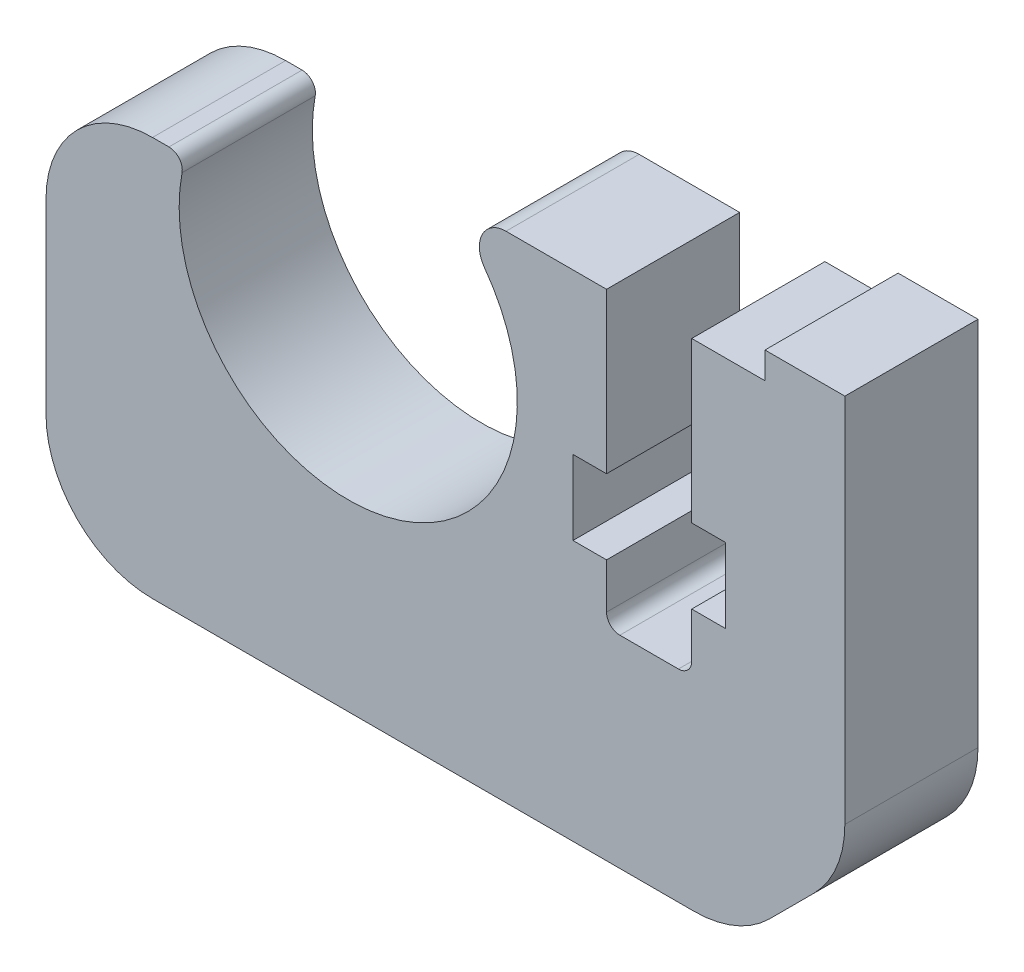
ISO-10303-21;
HEADER;
FILE_DESCRIPTION(('STEP AP214'),'2;1');
FILE_NAME('part.step','',(''),(''),'','','');
FILE_SCHEMA(('AUTOMOTIVE_DESIGN { 1 0 10303 214 1 1 1 1 }'));
ENDSEC;
DATA;
#1=APPLICATION_CONTEXT('core data for automotive mechanical design processes');
#2=APPLICATION_PROTOCOL_DEFINITION('international standard','automotive_design',2000,#1);
#3=PRODUCT_CONTEXT('',#1,'mechanical');
#4=PRODUCT('Part','Part','',(#3));
#5=PRODUCT_RELATED_PRODUCT_CATEGORY('part','',(#4));
#6=PRODUCT_DEFINITION_FORMATION('','',#4);
#7=PRODUCT_DEFINITION_CONTEXT('part definition',#1,'design');
#8=PRODUCT_DEFINITION('design','',#6,#7);
#9=PRODUCT_DEFINITION_SHAPE('','',#8);
#10=(LENGTH_UNIT() NAMED_UNIT(*) SI_UNIT(.MILLI.,.METRE.));
#11=(NAMED_UNIT(*) PLANE_ANGLE_UNIT() SI_UNIT($,.RADIAN.));
#12=(NAMED_UNIT(*) SI_UNIT($,.STERADIAN.) SOLID_ANGLE_UNIT());
#13=UNCERTAINTY_MEASURE_WITH_UNIT(LENGTH_MEASURE(1.E-05),#10,'distance_accuracy_value','');
#14=(GEOMETRIC_REPRESENTATION_CONTEXT(3) GLOBAL_UNCERTAINTY_ASSIGNED_CONTEXT((#13)) GLOBAL_UNIT_ASSIGNED_CONTEXT((#10,
#11,#12)) REPRESENTATION_CONTEXT('',''));
#15=CARTESIAN_POINT('',(0.,0.,0.));
#16=DIRECTION('',(0.,0.,1.));
#17=DIRECTION('',(1.,0.,0.));
#18=AXIS2_PLACEMENT_3D('',#15,#16,#17);
#19=CARTESIAN_POINT('',(-116.7,1.58749999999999,-34.425));
#20=DIRECTION('',(1.,0.,0.));
#21=DIRECTION('',(0.,0.,-1.));
#22=AXIS2_PLACEMENT_3D('',#19,#20,#21);
#23=PLANE('',#22);
#24=DIRECTION('',(0.,-1.,0.));
#25=VECTOR('',#24,1.);
#26=CARTESIAN_POINT('',(-116.7,1.58749999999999,-39.425));
#27=LINE('',#26,#25);
#28=CARTESIAN_POINT('',(-116.7,1.58749999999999,-39.425));
#29=VERTEX_POINT('',#28);
#30=CARTESIAN_POINT('',(-116.7,-12.3431457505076,-39.425));
#31=VERTEX_POINT('',#30);
#32=EDGE_CURVE('E253',#29,#31,#27,.T.);
#33=ORIENTED_EDGE('',*,*,#32,.F.);
#34=DIRECTION('',(0.,0.,-1.));
#35=VECTOR('',#34,1.);
#36=CARTESIAN_POINT('',(-116.7,1.58749999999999,-34.425));
#37=LINE('',#36,#35);
#38=CARTESIAN_POINT('',(-116.7,1.58749999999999,-34.425));
#39=VERTEX_POINT('',#38);
#40=EDGE_CURVE('E11',#39,#29,#37,.T.);
#41=ORIENTED_EDGE('',*,*,#40,.F.);
#42=DIRECTION('',(0.,-1.,0.));
#43=VECTOR('',#42,1.);
#44=CARTESIAN_POINT('',(-116.7,1.58749999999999,-34.425));
#45=LINE('',#44,#43);
#46=CARTESIAN_POINT('',(-116.7,-12.3431457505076,-34.425));
#47=VERTEX_POINT('',#46);
#48=EDGE_CURVE('E336',#39,#47,#45,.T.);
#49=ORIENTED_EDGE('',*,*,#48,.T.);
#50=DIRECTION('',(0.,0.,-1.));
#51=VECTOR('',#50,1.);
#52=CARTESIAN_POINT('',(-116.7,-12.3431457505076,-34.425));
#53=LINE('',#52,#51);
#54=EDGE_CURVE('E33',#47,#31,#53,.T.);
#55=ORIENTED_EDGE('',*,*,#54,.T.);
#56=EDGE_LOOP('',(#33,#41,#49,#55));
#57=FACE_BOUND('',#56,.T.);
#58=ADVANCED_FACE('F30',(#57),#23,.T.);
#59=CARTESIAN_POINT('',(-116.7,1.58749999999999,-34.425));
#60=DIRECTION('',(0.,1.,0.));
#61=DIRECTION('',(-1.,0.,0.));
#62=AXIS2_PLACEMENT_3D('',#59,#60,#61);
#63=PLANE('',#62);
#64=DIRECTION('',(1.,0.,0.));
#65=VECTOR('',#64,1.);
#66=CARTESIAN_POINT('',(-116.7,1.58749999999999,-39.425));
#67=LINE('',#66,#65);
#68=CARTESIAN_POINT('',(-119.7,1.58749999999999,-39.425));
#69=VERTEX_POINT('',#68);
#70=EDGE_CURVE('E334',#69,#29,#67,.T.);
#71=ORIENTED_EDGE('',*,*,#70,.F.);
#72=DIRECTION('',(0.,0.,-1.));
#73=VECTOR('',#72,1.);
#74=CARTESIAN_POINT('',(-119.7,1.58749999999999,-34.425));
#75=LINE('',#74,#73);
#76=CARTESIAN_POINT('',(-119.7,1.58749999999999,-34.425));
#77=VERTEX_POINT('',#76);
#78=EDGE_CURVE('E39',#77,#69,#75,.T.);
#79=ORIENTED_EDGE('',*,*,#78,.F.);
#80=DIRECTION('',(1.,0.,0.));
#81=VECTOR('',#80,1.);
#82=CARTESIAN_POINT('',(-116.7,1.58749999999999,-34.425));
#83=LINE('',#82,#81);
#84=EDGE_CURVE('E243',#77,#39,#83,.T.);
#85=ORIENTED_EDGE('',*,*,#84,.T.);
#86=ORIENTED_EDGE('',*,*,#40,.T.);
#87=EDGE_LOOP('',(#71,#79,#85,#86));
#88=FACE_BOUND('',#87,.T.);
#89=ADVANCED_FACE('F390',(#88),#63,.T.);
#90=CARTESIAN_POINT('',(-119.7,1.58749999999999,-34.425));
#91=DIRECTION('',(-1.,0.,0.));
#92=DIRECTION('',(0.,0.,1.));
#93=AXIS2_PLACEMENT_3D('',#90,#91,#92);
#94=PLANE('',#93);
#95=DIRECTION('',(0.,1.,0.));
#96=VECTOR('',#95,1.);
#97=CARTESIAN_POINT('',(-119.7,1.58749999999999,-39.425));
#98=LINE('',#97,#96);
#99=CARTESIAN_POINT('',(-119.7,0.587499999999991,-39.425));
#100=VERTEX_POINT('',#99);
#101=EDGE_CURVE('E230',#100,#69,#98,.T.);
#102=ORIENTED_EDGE('',*,*,#101,.F.);
#103=DIRECTION('',(0.,0.,-1.));
#104=VECTOR('',#103,1.);
#105=CARTESIAN_POINT('',(-119.7,0.587499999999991,-34.425));
#106=LINE('',#105,#104);
#107=CARTESIAN_POINT('',(-119.7,0.587499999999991,-34.425));
#108=VERTEX_POINT('',#107);
#109=EDGE_CURVE('E225',#108,#100,#106,.T.);
#110=ORIENTED_EDGE('',*,*,#109,.F.);
#111=DIRECTION('',(0.,1.,0.));
#112=VECTOR('',#111,1.);
#113=CARTESIAN_POINT('',(-119.7,1.58749999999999,-34.425));
#114=LINE('',#113,#112);
#115=EDGE_CURVE('E228',#108,#77,#114,.T.);
#116=ORIENTED_EDGE('',*,*,#115,.T.);
#117=ORIENTED_EDGE('',*,*,#78,.T.);
#118=EDGE_LOOP('',(#102,#110,#116,#117));
#119=FACE_BOUND('',#118,.T.);
#120=ADVANCED_FACE('F227',(#119),#94,.T.);
#121=CARTESIAN_POINT('',(-119.7,0.587499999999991,-34.425));
#122=DIRECTION('',(0.,1.,0.));
#123=DIRECTION('',(-1.,0.,0.));
#124=AXIS2_PLACEMENT_3D('',#121,#122,#123);
#125=PLANE('',#124);
#126=DIRECTION('',(1.,0.,0.));
#127=VECTOR('',#126,1.);
#128=CARTESIAN_POINT('',(-119.7,0.587499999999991,-39.425));
#129=LINE('',#128,#127);
#130=CARTESIAN_POINT('',(-122.45,0.587499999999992,-39.425));
#131=VERTEX_POINT('',#130);
#132=EDGE_CURVE('E331',#131,#100,#129,.T.);
#133=ORIENTED_EDGE('',*,*,#132,.F.);
#134=DIRECTION('',(0.,0.,-1.));
#135=VECTOR('',#134,1.);
#136=CARTESIAN_POINT('',(-122.45,0.587499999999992,-34.425));
#137=LINE('',#136,#135);
#138=CARTESIAN_POINT('',(-122.45,0.587499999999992,-34.425));
#139=VERTEX_POINT('',#138);
#140=EDGE_CURVE('E235',#139,#131,#137,.T.);
#141=ORIENTED_EDGE('',*,*,#140,.F.);
#142=DIRECTION('',(1.,0.,0.));
#143=VECTOR('',#142,1.);
#144=CARTESIAN_POINT('',(-119.7,0.587499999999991,-34.425));
#145=LINE('',#144,#143);
#146=EDGE_CURVE('E241',#139,#108,#145,.T.);
#147=ORIENTED_EDGE('',*,*,#146,.T.);
#148=ORIENTED_EDGE('',*,*,#109,.T.);
#149=EDGE_LOOP('',(#133,#141,#147,#148));
#150=FACE_BOUND('',#149,.T.);
#151=ADVANCED_FACE('F245',(#150),#125,.T.);
#152=CARTESIAN_POINT('',(-122.45,0.587499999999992,-34.425));
#153=DIRECTION('',(-1.,0.,0.));
#154=DIRECTION('',(0.,0.,1.));
#155=AXIS2_PLACEMENT_3D('',#152,#153,#154);
#156=PLANE('',#155);
#157=DIRECTION('',(0.,1.,0.));
#158=VECTOR('',#157,1.);
#159=CARTESIAN_POINT('',(-122.45,0.587499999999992,-39.425));
#160=LINE('',#159,#158);
#161=CARTESIAN_POINT('',(-122.45,-5.41250000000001,-39.425));
#162=VERTEX_POINT('',#161);
#163=EDGE_CURVE('E328',#162,#131,#160,.T.);
#164=ORIENTED_EDGE('',*,*,#163,.F.);
#165=DIRECTION('',(0.,0.,-1.));
#166=VECTOR('',#165,1.);
#167=CARTESIAN_POINT('',(-122.45,-5.41250000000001,-34.425));
#168=LINE('',#167,#166);
#169=CARTESIAN_POINT('',(-122.45,-5.41250000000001,-34.425));
#170=VERTEX_POINT('',#169);
#171=EDGE_CURVE('E340',#170,#162,#168,.T.);
#172=ORIENTED_EDGE('',*,*,#171,.F.);
#173=DIRECTION('',(0.,1.,0.));
#174=VECTOR('',#173,1.);
#175=CARTESIAN_POINT('',(-122.45,0.587499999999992,-34.425));
#176=LINE('',#175,#174);
#177=EDGE_CURVE('E246',#170,#139,#176,.T.);
#178=ORIENTED_EDGE('',*,*,#177,.T.);
#179=ORIENTED_EDGE('',*,*,#140,.T.);
#180=EDGE_LOOP('',(#164,#172,#178,#179));
#181=FACE_BOUND('',#180,.T.);
#182=ADVANCED_FACE('F403',(#181),#156,.T.);
#183=CARTESIAN_POINT('',(-122.45,-5.41250000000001,-34.425));
#184=DIRECTION('',(0.,-1.,0.));
#185=DIRECTION('',(1.,0.,0.));
#186=AXIS2_PLACEMENT_3D('',#183,#184,#185);
#187=PLANE('',#186);
#188=DIRECTION('',(-1.,0.,0.));
#189=VECTOR('',#188,1.);
#190=CARTESIAN_POINT('',(-122.45,-5.41250000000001,-39.425));
#191=LINE('',#190,#189);
#192=CARTESIAN_POINT('',(-121.19,-5.41250000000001,-39.425));
#193=VERTEX_POINT('',#192);
#194=EDGE_CURVE('E325',#193,#162,#191,.T.);
#195=ORIENTED_EDGE('',*,*,#194,.F.);
#196=DIRECTION('',(0.,0.,-1.));
#197=VECTOR('',#196,1.);
#198=CARTESIAN_POINT('',(-121.19,-5.41250000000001,-34.425));
#199=LINE('',#198,#197);
#200=CARTESIAN_POINT('',(-121.19,-5.41250000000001,-34.425));
#201=VERTEX_POINT('',#200);
#202=EDGE_CURVE('E342',#201,#193,#199,.T.);
#203=ORIENTED_EDGE('',*,*,#202,.F.);
#204=DIRECTION('',(-1.,0.,0.));
#205=VECTOR('',#204,1.);
#206=CARTESIAN_POINT('',(-122.45,-5.41250000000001,-34.425));
#207=LINE('',#206,#205);
#208=EDGE_CURVE('E248',#201,#170,#207,.T.);
#209=ORIENTED_EDGE('',*,*,#208,.T.);
#210=ORIENTED_EDGE('',*,*,#171,.T.);
#211=EDGE_LOOP('',(#195,#203,#209,#210));
#212=FACE_BOUND('',#211,.T.);
#213=ADVANCED_FACE('F406',(#212),#187,.T.);
#214=CARTESIAN_POINT('',(-121.19,-5.41250000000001,-34.425));
#215=DIRECTION('',(-1.,0.,0.));
#216=DIRECTION('',(0.,0.,1.));
#217=AXIS2_PLACEMENT_3D('',#214,#215,#216);
#218=PLANE('',#217);
#219=DIRECTION('',(0.,1.,0.));
#220=VECTOR('',#219,1.);
#221=CARTESIAN_POINT('',(-121.19,-5.41250000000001,-39.425));
#222=LINE('',#221,#220);
#223=CARTESIAN_POINT('',(-121.19,-8.21250000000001,-39.425));
#224=VERTEX_POINT('',#223);
#225=EDGE_CURVE('E322',#224,#193,#222,.T.);
#226=ORIENTED_EDGE('',*,*,#225,.F.);
#227=DIRECTION('',(0.,0.,-1.));
#228=VECTOR('',#227,1.);
#229=CARTESIAN_POINT('',(-121.19,-8.21250000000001,-34.425));
#230=LINE('',#229,#228);
#231=CARTESIAN_POINT('',(-121.19,-8.21250000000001,-34.425));
#232=VERTEX_POINT('',#231);
#233=EDGE_CURVE('E344',#232,#224,#230,.T.);
#234=ORIENTED_EDGE('',*,*,#233,.F.);
#235=DIRECTION('',(0.,1.,0.));
#236=VECTOR('',#235,1.);
#237=CARTESIAN_POINT('',(-121.19,-5.41250000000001,-34.425));
#238=LINE('',#237,#236);
#239=EDGE_CURVE('E768',#232,#201,#238,.T.);
#240=ORIENTED_EDGE('',*,*,#239,.T.);
#241=ORIENTED_EDGE('',*,*,#202,.T.);
#242=EDGE_LOOP('',(#226,#234,#240,#241));
#243=FACE_BOUND('',#242,.T.);
#244=ADVANCED_FACE('F410',(#243),#218,.T.);
#245=CARTESIAN_POINT('',(-121.19,-8.21250000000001,-34.425));
#246=DIRECTION('',(0.,1.,0.));
#247=DIRECTION('',(0.,0.,1.));
#248=AXIS2_PLACEMENT_3D('',#245,#246,#247);
#249=PLANE('',#248);
#250=DIRECTION('',(1.,0.,0.));
#251=VECTOR('',#250,1.);
#252=CARTESIAN_POINT('',(-121.19,-8.21250000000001,-39.425));
#253=LINE('',#252,#251);
#254=CARTESIAN_POINT('',(-122.45,-8.21250000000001,-39.425));
#255=VERTEX_POINT('',#254);
#256=EDGE_CURVE('E319',#255,#224,#253,.T.);
#257=ORIENTED_EDGE('',*,*,#256,.F.);
#258=DIRECTION('',(0.,0.,-1.));
#259=VECTOR('',#258,1.);
#260=CARTESIAN_POINT('',(-122.45,-8.21250000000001,-34.425));
#261=LINE('',#260,#259);
#262=CARTESIAN_POINT('',(-122.45,-8.21250000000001,-34.425));
#263=VERTEX_POINT('',#262);
#264=EDGE_CURVE('E346',#263,#255,#261,.T.);
#265=ORIENTED_EDGE('',*,*,#264,.F.);
#266=DIRECTION('',(1.,0.,0.));
#267=VECTOR('',#266,1.);
#268=CARTESIAN_POINT('',(-121.19,-8.21250000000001,-34.425));
#269=LINE('',#268,#267);
#270=EDGE_CURVE('E761',#263,#232,#269,.T.);
#271=ORIENTED_EDGE('',*,*,#270,.T.);
#272=ORIENTED_EDGE('',*,*,#233,.T.);
#273=EDGE_LOOP('',(#257,#265,#271,#272));
#274=FACE_BOUND('',#273,.T.);
#275=ADVANCED_FACE('F414',(#274),#249,.T.);
#276=CARTESIAN_POINT('',(-122.45,-8.21250000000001,-34.425));
#277=DIRECTION('',(-1.,0.,0.));
#278=DIRECTION('',(0.,0.,1.));
#279=AXIS2_PLACEMENT_3D('',#276,#277,#278);
#280=PLANE('',#279);
#281=DIRECTION('',(0.,1.,0.));
#282=VECTOR('',#281,1.);
#283=CARTESIAN_POINT('',(-122.45,-8.21250000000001,-39.425));
#284=LINE('',#283,#282);
#285=CARTESIAN_POINT('',(-122.45,-9.9125,-39.425));
#286=VERTEX_POINT('',#285);
#287=EDGE_CURVE('E316',#286,#255,#284,.T.);
#288=ORIENTED_EDGE('',*,*,#287,.F.);
#289=DIRECTION('',(0.,0.,-1.));
#290=VECTOR('',#289,1.);
#291=CARTESIAN_POINT('',(-122.45,-9.9125,-34.425));
#292=LINE('',#291,#290);
#293=CARTESIAN_POINT('',(-122.45,-9.9125,-34.425));
#294=VERTEX_POINT('',#293);
#295=EDGE_CURVE('E348',#294,#286,#292,.T.);
#296=ORIENTED_EDGE('',*,*,#295,.F.);
#297=DIRECTION('',(0.,1.,0.));
#298=VECTOR('',#297,1.);
#299=CARTESIAN_POINT('',(-122.45,-8.21250000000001,-34.425));
#300=LINE('',#299,#298);
#301=EDGE_CURVE('E757',#294,#263,#300,.T.);
#302=ORIENTED_EDGE('',*,*,#301,.T.);
#303=ORIENTED_EDGE('',*,*,#264,.T.);
#304=EDGE_LOOP('',(#288,#296,#302,#303));
#305=FACE_BOUND('',#304,.T.);
#306=ADVANCED_FACE('F418',(#305),#280,.T.);
#307=CARTESIAN_POINT('',(-122.95,-9.91250000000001,-34.425));
#308=DIRECTION('',(0.,0.,-1.));
#309=DIRECTION('',(-1.,0.,0.));
#310=AXIS2_PLACEMENT_3D('',#307,#308,#309);
#311=CYLINDRICAL_SURFACE('',#310,0.5);
#312=CARTESIAN_POINT('',(-122.95,-9.91250000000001,-39.425));
#313=DIRECTION('',(0.,0.,1.));
#314=DIRECTION('',(1.,0.,0.));
#315=AXIS2_PLACEMENT_3D('',#312,#313,#314);
#316=CIRCLE('',#315,0.5);
#317=CARTESIAN_POINT('',(-122.95,-10.4125,-39.425));
#318=VERTEX_POINT('',#317);
#319=EDGE_CURVE('E313',#318,#286,#316,.T.);
#320=ORIENTED_EDGE('',*,*,#319,.F.);
#321=DIRECTION('',(0.,0.,-1.));
#322=VECTOR('',#321,1.);
#323=CARTESIAN_POINT('',(-122.95,-10.4125,-34.425));
#324=LINE('',#323,#322);
#325=CARTESIAN_POINT('',(-122.95,-10.4125,-34.425));
#326=VERTEX_POINT('',#325);
#327=EDGE_CURVE('E350',#326,#318,#324,.T.);
#328=ORIENTED_EDGE('',*,*,#327,.F.);
#329=CARTESIAN_POINT('',(-122.95,-9.91250000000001,-34.425));
#330=DIRECTION('',(0.,0.,1.));
#331=DIRECTION('',(1.,0.,0.));
#332=AXIS2_PLACEMENT_3D('',#329,#330,#331);
#333=CIRCLE('',#332,0.5);
#334=EDGE_CURVE('E773',#326,#294,#333,.T.);
#335=ORIENTED_EDGE('',*,*,#334,.T.);
#336=ORIENTED_EDGE('',*,*,#295,.T.);
#337=EDGE_LOOP('',(#320,#328,#335,#336));
#338=FACE_BOUND('',#337,.T.);
#339=ADVANCED_FACE('F422',(#338),#311,.F.);
#340=CARTESIAN_POINT('',(-122.95,-10.4125,-34.425));
#341=DIRECTION('',(0.,1.,0.));
#342=DIRECTION('',(0.,0.,1.));
#343=AXIS2_PLACEMENT_3D('',#340,#341,#342);
#344=PLANE('',#343);
#345=DIRECTION('',(1.,0.,0.));
#346=VECTOR('',#345,1.);
#347=CARTESIAN_POINT('',(-122.95,-10.4125,-39.425));
#348=LINE('',#347,#346);
#349=CARTESIAN_POINT('',(-125.15,-10.4125,-39.425));
#350=VERTEX_POINT('',#349);
#351=EDGE_CURVE('E310',#350,#318,#348,.T.);
#352=ORIENTED_EDGE('',*,*,#351,.F.);
#353=DIRECTION('',(0.,0.,-1.));
#354=VECTOR('',#353,1.);
#355=CARTESIAN_POINT('',(-125.15,-10.4125,-34.425));
#356=LINE('',#355,#354);
#357=CARTESIAN_POINT('',(-125.15,-10.4125,-34.425));
#358=VERTEX_POINT('',#357);
#359=EDGE_CURVE('E352',#358,#350,#356,.T.);
#360=ORIENTED_EDGE('',*,*,#359,.F.);
#361=DIRECTION('',(1.,0.,0.));
#362=VECTOR('',#361,1.);
#363=CARTESIAN_POINT('',(-122.95,-10.4125,-34.425));
#364=LINE('',#363,#362);
#365=EDGE_CURVE('E750',#358,#326,#364,.T.);
#366=ORIENTED_EDGE('',*,*,#365,.T.);
#367=ORIENTED_EDGE('',*,*,#327,.T.);
#368=EDGE_LOOP('',(#352,#360,#366,#367));
#369=FACE_BOUND('',#368,.T.);
#370=ADVANCED_FACE('F426',(#369),#344,.T.);
#371=CARTESIAN_POINT('',(-125.15,-9.91250000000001,-34.425));
#372=DIRECTION('',(0.,0.,-1.));
#373=DIRECTION('',(-1.,0.,0.));
#374=AXIS2_PLACEMENT_3D('',#371,#372,#373);
#375=CYLINDRICAL_SURFACE('',#374,0.5);
#376=CARTESIAN_POINT('',(-125.15,-9.91250000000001,-39.425));
#377=DIRECTION('',(0.,0.,1.));
#378=DIRECTION('',(-1.,0.,0.));
#379=AXIS2_PLACEMENT_3D('',#376,#377,#378);
#380=CIRCLE('',#379,0.5);
#381=CARTESIAN_POINT('',(-125.65,-9.9125,-39.425));
#382=VERTEX_POINT('',#381);
#383=EDGE_CURVE('E307',#382,#350,#380,.T.);
#384=ORIENTED_EDGE('',*,*,#383,.F.);
#385=DIRECTION('',(0.,0.,-1.));
#386=VECTOR('',#385,1.);
#387=CARTESIAN_POINT('',(-125.65,-9.9125,-34.425));
#388=LINE('',#387,#386);
#389=CARTESIAN_POINT('',(-125.65,-9.9125,-34.425));
#390=VERTEX_POINT('',#389);
#391=EDGE_CURVE('E354',#390,#382,#388,.T.);
#392=ORIENTED_EDGE('',*,*,#391,.F.);
#393=CARTESIAN_POINT('',(-125.15,-9.91250000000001,-34.425));
#394=DIRECTION('',(0.,0.,1.));
#395=DIRECTION('',(-1.,0.,0.));
#396=AXIS2_PLACEMENT_3D('',#393,#394,#395);
#397=CIRCLE('',#396,0.5);
#398=EDGE_CURVE('E746',#390,#358,#397,.T.);
#399=ORIENTED_EDGE('',*,*,#398,.T.);
#400=ORIENTED_EDGE('',*,*,#359,.T.);
#401=EDGE_LOOP('',(#384,#392,#399,#400));
#402=FACE_BOUND('',#401,.T.);
#403=ADVANCED_FACE('F430',(#402),#375,.F.);
#404=CARTESIAN_POINT('',(-125.65,-8.21250000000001,-34.425));
#405=DIRECTION('',(1.,0.,0.));
#406=DIRECTION('',(0.,0.,-1.));
#407=AXIS2_PLACEMENT_3D('',#404,#405,#406);
#408=PLANE('',#407);
#409=DIRECTION('',(0.,-1.,0.));
#410=VECTOR('',#409,1.);
#411=CARTESIAN_POINT('',(-125.65,-8.21250000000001,-39.425));
#412=LINE('',#411,#410);
#413=CARTESIAN_POINT('',(-125.65,-8.21250000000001,-39.425));
#414=VERTEX_POINT('',#413);
#415=EDGE_CURVE('E304',#414,#382,#412,.T.);
#416=ORIENTED_EDGE('',*,*,#415,.F.);
#417=DIRECTION('',(0.,0.,-1.));
#418=VECTOR('',#417,1.);
#419=CARTESIAN_POINT('',(-125.65,-8.21250000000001,-34.425));
#420=LINE('',#419,#418);
#421=CARTESIAN_POINT('',(-125.65,-8.21250000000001,-34.425));
#422=VERTEX_POINT('',#421);
#423=EDGE_CURVE('E356',#422,#414,#420,.T.);
#424=ORIENTED_EDGE('',*,*,#423,.F.);
#425=DIRECTION('',(0.,-1.,0.));
#426=VECTOR('',#425,1.);
#427=CARTESIAN_POINT('',(-125.65,-8.21250000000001,-34.425));
#428=LINE('',#427,#426);
#429=EDGE_CURVE('E777',#422,#390,#428,.T.);
#430=ORIENTED_EDGE('',*,*,#429,.T.);
#431=ORIENTED_EDGE('',*,*,#391,.T.);
#432=EDGE_LOOP('',(#416,#424,#430,#431));
#433=FACE_BOUND('',#432,.T.);
#434=ADVANCED_FACE('F434',(#433),#408,.T.);
#435=CARTESIAN_POINT('',(-126.91,-8.21250000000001,-34.425));
#436=DIRECTION('',(0.,1.,0.));
#437=DIRECTION('',(0.,0.,1.));
#438=AXIS2_PLACEMENT_3D('',#435,#436,#437);
#439=PLANE('',#438);
#440=DIRECTION('',(1.,0.,0.));
#441=VECTOR('',#440,1.);
#442=CARTESIAN_POINT('',(-126.91,-8.21250000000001,-39.425));
#443=LINE('',#442,#441);
#444=CARTESIAN_POINT('',(-126.91,-8.21250000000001,-39.425));
#445=VERTEX_POINT('',#444);
#446=EDGE_CURVE('E301',#445,#414,#443,.T.);
#447=ORIENTED_EDGE('',*,*,#446,.F.);
#448=DIRECTION('',(0.,0.,-1.));
#449=VECTOR('',#448,1.);
#450=CARTESIAN_POINT('',(-126.91,-8.21250000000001,-34.425));
#451=LINE('',#450,#449);
#452=CARTESIAN_POINT('',(-126.91,-8.21250000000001,-34.425));
#453=VERTEX_POINT('',#452);
#454=EDGE_CURVE('E358',#453,#445,#451,.T.);
#455=ORIENTED_EDGE('',*,*,#454,.F.);
#456=DIRECTION('',(1.,0.,0.));
#457=VECTOR('',#456,1.);
#458=CARTESIAN_POINT('',(-126.91,-8.21250000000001,-34.425));
#459=LINE('',#458,#457);
#460=EDGE_CURVE('E739',#453,#422,#459,.T.);
#461=ORIENTED_EDGE('',*,*,#460,.T.);
#462=ORIENTED_EDGE('',*,*,#423,.T.);
#463=EDGE_LOOP('',(#447,#455,#461,#462));
#464=FACE_BOUND('',#463,.T.);
#465=ADVANCED_FACE('F438',(#464),#439,.T.);
#466=CARTESIAN_POINT('',(-126.91,-5.41250000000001,-34.425));
#467=DIRECTION('',(1.,0.,0.));
#468=DIRECTION('',(0.,0.,-1.));
#469=AXIS2_PLACEMENT_3D('',#466,#467,#468);
#470=PLANE('',#469);
#471=DIRECTION('',(0.,-1.,0.));
#472=VECTOR('',#471,1.);
#473=CARTESIAN_POINT('',(-126.91,-5.41250000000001,-39.425));
#474=LINE('',#473,#472);
#475=CARTESIAN_POINT('',(-126.91,-5.41250000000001,-39.425));
#476=VERTEX_POINT('',#475);
#477=EDGE_CURVE('E298',#476,#445,#474,.T.);
#478=ORIENTED_EDGE('',*,*,#477,.F.);
#479=DIRECTION('',(0.,0.,-1.));
#480=VECTOR('',#479,1.);
#481=CARTESIAN_POINT('',(-126.91,-5.41250000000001,-34.425));
#482=LINE('',#481,#480);
#483=CARTESIAN_POINT('',(-126.91,-5.41250000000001,-34.425));
#484=VERTEX_POINT('',#483);
#485=EDGE_CURVE('E360',#484,#476,#482,.T.);
#486=ORIENTED_EDGE('',*,*,#485,.F.);
#487=DIRECTION('',(0.,-1.,0.));
#488=VECTOR('',#487,1.);
#489=CARTESIAN_POINT('',(-126.91,-5.41250000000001,-34.425));
#490=LINE('',#489,#488);
#491=EDGE_CURVE('E735',#484,#453,#490,.T.);
#492=ORIENTED_EDGE('',*,*,#491,.T.);
#493=ORIENTED_EDGE('',*,*,#454,.T.);
#494=EDGE_LOOP('',(#478,#486,#492,#493));
#495=FACE_BOUND('',#494,.T.);
#496=ADVANCED_FACE('F442',(#495),#470,.T.);
#497=CARTESIAN_POINT('',(-125.65,-5.41250000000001,-34.425));
#498=DIRECTION('',(0.,-1.,0.));
#499=DIRECTION('',(1.,0.,0.));
#500=AXIS2_PLACEMENT_3D('',#497,#498,#499);
#501=PLANE('',#500);
#502=DIRECTION('',(-1.,0.,0.));
#503=VECTOR('',#502,1.);
#504=CARTESIAN_POINT('',(-125.65,-5.41250000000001,-39.425));
#505=LINE('',#504,#503);
#506=CARTESIAN_POINT('',(-125.65,-5.41250000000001,-39.425));
#507=VERTEX_POINT('',#506);
#508=EDGE_CURVE('E295',#507,#476,#505,.T.);
#509=ORIENTED_EDGE('',*,*,#508,.F.);
#510=DIRECTION('',(0.,0.,-1.));
#511=VECTOR('',#510,1.);
#512=CARTESIAN_POINT('',(-125.65,-5.41250000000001,-34.425));
#513=LINE('',#512,#511);
#514=CARTESIAN_POINT('',(-125.65,-5.41250000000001,-34.425));
#515=VERTEX_POINT('',#514);
#516=EDGE_CURVE('E362',#515,#507,#513,.T.);
#517=ORIENTED_EDGE('',*,*,#516,.F.);
#518=DIRECTION('',(-1.,0.,0.));
#519=VECTOR('',#518,1.);
#520=CARTESIAN_POINT('',(-125.65,-5.41250000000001,-34.425));
#521=LINE('',#520,#519);
#522=EDGE_CURVE('E781',#515,#484,#521,.T.);
#523=ORIENTED_EDGE('',*,*,#522,.T.);
#524=ORIENTED_EDGE('',*,*,#485,.T.);
#525=EDGE_LOOP('',(#509,#517,#523,#524));
#526=FACE_BOUND('',#525,.T.);
#527=ADVANCED_FACE('F446',(#526),#501,.T.);
#528=CARTESIAN_POINT('',(-125.65,0.587499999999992,-34.425));
#529=DIRECTION('',(1.,0.,0.));
#530=DIRECTION('',(0.,0.,-1.));
#531=AXIS2_PLACEMENT_3D('',#528,#529,#530);
#532=PLANE('',#531);
#533=DIRECTION('',(0.,-1.,0.));
#534=VECTOR('',#533,1.);
#535=CARTESIAN_POINT('',(-125.65,0.587499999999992,-39.425));
#536=LINE('',#535,#534);
#537=CARTESIAN_POINT('',(-125.65,0.587499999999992,-39.425));
#538=VERTEX_POINT('',#537);
#539=EDGE_CURVE('E292',#538,#507,#536,.T.);
#540=ORIENTED_EDGE('',*,*,#539,.F.);
#541=DIRECTION('',(0.,0.,-1.));
#542=VECTOR('',#541,1.);
#543=CARTESIAN_POINT('',(-125.65,0.587499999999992,-34.425));
#544=LINE('',#543,#542);
#545=CARTESIAN_POINT('',(-125.65,0.587499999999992,-34.425));
#546=VERTEX_POINT('',#545);
#547=EDGE_CURVE('E364',#546,#538,#544,.T.);
#548=ORIENTED_EDGE('',*,*,#547,.F.);
#549=DIRECTION('',(0.,-1.,0.));
#550=VECTOR('',#549,1.);
#551=CARTESIAN_POINT('',(-125.65,0.587499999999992,-34.425));
#552=LINE('',#551,#550);
#553=EDGE_CURVE('E728',#546,#515,#552,.T.);
#554=ORIENTED_EDGE('',*,*,#553,.T.);
#555=ORIENTED_EDGE('',*,*,#516,.T.);
#556=EDGE_LOOP('',(#540,#548,#554,#555));
#557=FACE_BOUND('',#556,.T.);
#558=ADVANCED_FACE('F450',(#557),#532,.T.);
#559=CARTESIAN_POINT('',(-125.65,0.587499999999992,-34.425));
#560=DIRECTION('',(0.,1.,0.));
#561=DIRECTION('',(-1.,0.,0.));
#562=AXIS2_PLACEMENT_3D('',#559,#560,#561);
#563=PLANE('',#562);
#564=DIRECTION('',(1.,0.,0.));
#565=VECTOR('',#564,1.);
#566=CARTESIAN_POINT('',(-125.65,0.587499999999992,-39.425));
#567=LINE('',#566,#565);
#568=CARTESIAN_POINT('',(-129.425474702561,0.587499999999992,-39.425));
#569=VERTEX_POINT('',#568);
#570=EDGE_CURVE('E289',#569,#538,#567,.T.);
#571=ORIENTED_EDGE('',*,*,#570,.F.);
#572=DIRECTION('',(0.,0.,-1.));
#573=VECTOR('',#572,1.);
#574=CARTESIAN_POINT('',(-129.425474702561,0.587499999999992,-34.425));
#575=LINE('',#574,#573);
#576=CARTESIAN_POINT('',(-129.425474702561,0.587499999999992,-34.425));
#577=VERTEX_POINT('',#576);
#578=EDGE_CURVE('E366',#577,#569,#575,.T.);
#579=ORIENTED_EDGE('',*,*,#578,.F.);
#580=DIRECTION('',(1.,0.,0.));
#581=VECTOR('',#580,1.);
#582=CARTESIAN_POINT('',(-125.65,0.587499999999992,-34.425));
#583=LINE('',#582,#581);
#584=EDGE_CURVE('E724',#577,#546,#583,.T.);
#585=ORIENTED_EDGE('',*,*,#584,.T.);
#586=ORIENTED_EDGE('',*,*,#547,.T.);
#587=EDGE_LOOP('',(#571,#579,#585,#586));
#588=FACE_BOUND('',#587,.T.);
#589=ADVANCED_FACE('F454',(#588),#563,.T.);
#590=CARTESIAN_POINT('',(-129.425474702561,-0.412500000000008,-34.425));
#591=DIRECTION('',(0.,0.,-1.));
#592=DIRECTION('',(-1.,0.,0.));
#593=AXIS2_PLACEMENT_3D('',#590,#591,#592);
#594=CYLINDRICAL_SURFACE('',#593,0.999999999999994);
#595=CARTESIAN_POINT('',(-129.425474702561,-0.412500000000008,-39.425));
#596=DIRECTION('',(0.,0.,-1.));
#597=DIRECTION('',(-1.,0.,0.));
#598=AXIS2_PLACEMENT_3D('',#595,#596,#597);
#599=CIRCLE('',#598,0.999999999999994);
#600=CARTESIAN_POINT('',(-130.231532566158,-1.00433673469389,-39.425));
#601=VERTEX_POINT('',#600);
#602=EDGE_CURVE('E286',#601,#569,#599,.T.);
#603=ORIENTED_EDGE('',*,*,#602,.F.);
#604=DIRECTION('',(0.,0.,-1.));
#605=VECTOR('',#604,1.);
#606=CARTESIAN_POINT('',(-130.231532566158,-1.00433673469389,-34.425));
#607=LINE('',#606,#605);
#608=CARTESIAN_POINT('',(-130.231532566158,-1.00433673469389,-34.425));
#609=VERTEX_POINT('',#608);
#610=EDGE_CURVE('E368',#609,#601,#607,.T.);
#611=ORIENTED_EDGE('',*,*,#610,.F.);
#612=CARTESIAN_POINT('',(-129.425474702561,-0.412500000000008,-34.425));
#613=DIRECTION('',(0.,0.,-1.));
#614=DIRECTION('',(-1.,0.,0.));
#615=AXIS2_PLACEMENT_3D('',#612,#613,#614);
#616=CIRCLE('',#615,0.999999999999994);
#617=EDGE_CURVE('E785',#609,#577,#616,.T.);
#618=ORIENTED_EDGE('',*,*,#617,.T.);
#619=ORIENTED_EDGE('',*,*,#578,.T.);
#620=EDGE_LOOP('',(#603,#611,#618,#619));
#621=FACE_BOUND('',#620,.T.);
#622=ADVANCED_FACE('F458',(#621),#594,.T.);
#623=CARTESIAN_POINT('',(-135.35,-4.7625,-34.425));
#624=DIRECTION('',(0.,0.,-1.));
#625=DIRECTION('',(-1.,0.,0.));
#626=AXIS2_PLACEMENT_3D('',#623,#624,#625);
#627=CYLINDRICAL_SURFACE('',#626,6.35);
#628=CARTESIAN_POINT('',(-135.35,-4.7625,-39.425));
#629=DIRECTION('',(0.,0.,1.));
#630=DIRECTION('',(-1.,0.,0.));
#631=AXIS2_PLACEMENT_3D('',#628,#629,#630);
#632=CIRCLE('',#631,6.35);
#633=CARTESIAN_POINT('',(-141.591216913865,-3.59215328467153,-39.425));
#634=VERTEX_POINT('',#633);
#635=EDGE_CURVE('E283',#634,#601,#632,.T.);
#636=ORIENTED_EDGE('',*,*,#635,.F.);
#637=DIRECTION('',(0.,0.,-1.));
#638=VECTOR('',#637,1.);
#639=CARTESIAN_POINT('',(-141.591216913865,-3.59215328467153,-34.425));
#640=LINE('',#639,#638);
#641=CARTESIAN_POINT('',(-141.591216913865,-3.59215328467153,-34.425));
#642=VERTEX_POINT('',#641);
#643=EDGE_CURVE('E370',#642,#634,#640,.T.);
#644=ORIENTED_EDGE('',*,*,#643,.F.);
#645=CARTESIAN_POINT('',(-135.35,-4.7625,-34.425));
#646=DIRECTION('',(0.,0.,1.));
#647=DIRECTION('',(-1.,0.,0.));
#648=AXIS2_PLACEMENT_3D('',#645,#646,#647);
#649=CIRCLE('',#648,6.35);
#650=EDGE_CURVE('E717',#642,#609,#649,.T.);
#651=ORIENTED_EDGE('',*,*,#650,.T.);
#652=ORIENTED_EDGE('',*,*,#610,.T.);
#653=EDGE_LOOP('',(#636,#644,#651,#652));
#654=FACE_BOUND('',#653,.T.);
#655=ADVANCED_FACE('F462',(#654),#627,.F.);
#656=CARTESIAN_POINT('',(-142.082651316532,-3.5,-34.425));
#657=DIRECTION('',(0.,0.,-1.));
#658=DIRECTION('',(-1.,0.,0.));
#659=AXIS2_PLACEMENT_3D('',#656,#657,#658);
#660=CYLINDRICAL_SURFACE('',#659,0.499999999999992);
#661=CARTESIAN_POINT('',(-142.082651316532,-3.5,-39.425));
#662=DIRECTION('',(0.,0.,-1.));
#663=DIRECTION('',(1.,0.,0.));
#664=AXIS2_PLACEMENT_3D('',#661,#662,#663);
#665=CIRCLE('',#664,0.499999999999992);
#666=CARTESIAN_POINT('',(-142.082651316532,-3.00000000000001,-39.425));
#667=VERTEX_POINT('',#666);
#668=EDGE_CURVE('E280',#667,#634,#665,.T.);
#669=ORIENTED_EDGE('',*,*,#668,.F.);
#670=DIRECTION('',(0.,0.,-1.));
#671=VECTOR('',#670,1.);
#672=CARTESIAN_POINT('',(-142.082651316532,-3.00000000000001,-34.425));
#673=LINE('',#672,#671);
#674=CARTESIAN_POINT('',(-142.082651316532,-3.00000000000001,-34.425));
#675=VERTEX_POINT('',#674);
#676=EDGE_CURVE('E372',#675,#667,#673,.T.);
#677=ORIENTED_EDGE('',*,*,#676,.F.);
#678=CARTESIAN_POINT('',(-142.082651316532,-3.5,-34.425));
#679=DIRECTION('',(0.,0.,-1.));
#680=DIRECTION('',(1.,0.,0.));
#681=AXIS2_PLACEMENT_3D('',#678,#679,#680);
#682=CIRCLE('',#681,0.499999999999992);
#683=EDGE_CURVE('E713',#675,#642,#682,.T.);
#684=ORIENTED_EDGE('',*,*,#683,.T.);
#685=ORIENTED_EDGE('',*,*,#643,.T.);
#686=EDGE_LOOP('',(#669,#677,#684,#685));
#687=FACE_BOUND('',#686,.T.);
#688=ADVANCED_FACE('F466',(#687),#660,.T.);
#689=CARTESIAN_POINT('',(-142.7,-3.,-34.425));
#690=DIRECTION('',(0.,1.,0.));
#691=DIRECTION('',(0.,0.,1.));
#692=AXIS2_PLACEMENT_3D('',#689,#690,#691);
#693=PLANE('',#692);
#694=DIRECTION('',(1.,0.,0.));
#695=VECTOR('',#694,1.);
#696=CARTESIAN_POINT('',(-142.7,-3.,-39.425));
#697=LINE('',#696,#695);
#698=CARTESIAN_POINT('',(-142.7,-3.,-39.425));
#699=VERTEX_POINT('',#698);
#700=EDGE_CURVE('E277',#699,#667,#697,.T.);
#701=ORIENTED_EDGE('',*,*,#700,.F.);
#702=DIRECTION('',(0.,0.,-1.));
#703=VECTOR('',#702,1.);
#704=CARTESIAN_POINT('',(-142.7,-3.,-34.425));
#705=LINE('',#704,#703);
#706=CARTESIAN_POINT('',(-142.7,-3.,-34.425));
#707=VERTEX_POINT('',#706);
#708=EDGE_CURVE('E374',#707,#699,#705,.T.);
#709=ORIENTED_EDGE('',*,*,#708,.F.);
#710=DIRECTION('',(1.,0.,0.));
#711=VECTOR('',#710,1.);
#712=CARTESIAN_POINT('',(-142.7,-3.,-34.425));
#713=LINE('',#712,#711);
#714=EDGE_CURVE('E789',#707,#675,#713,.T.);
#715=ORIENTED_EDGE('',*,*,#714,.T.);
#716=ORIENTED_EDGE('',*,*,#676,.T.);
#717=EDGE_LOOP('',(#701,#709,#715,#716));
#718=FACE_BOUND('',#717,.T.);
#719=ADVANCED_FACE('F470',(#718),#693,.T.);
#720=CARTESIAN_POINT('',(-142.7,-7.,-34.425));
#721=DIRECTION('',(0.,0.,-1.));
#722=DIRECTION('',(-1.,0.,0.));
#723=AXIS2_PLACEMENT_3D('',#720,#721,#722);
#724=CYLINDRICAL_SURFACE('',#723,4.);
#725=CARTESIAN_POINT('',(-142.7,-7.,-39.425));
#726=DIRECTION('',(0.,0.,-1.));
#727=DIRECTION('',(-1.,0.,0.));
#728=AXIS2_PLACEMENT_3D('',#725,#726,#727);
#729=CIRCLE('',#728,4.);
#730=CARTESIAN_POINT('',(-146.7,-7.00000000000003,-39.425));
#731=VERTEX_POINT('',#730);
#732=EDGE_CURVE('E274',#731,#699,#729,.T.);
#733=ORIENTED_EDGE('',*,*,#732,.F.);
#734=DIRECTION('',(0.,0.,-1.));
#735=VECTOR('',#734,1.);
#736=CARTESIAN_POINT('',(-146.7,-7.00000000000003,-34.425));
#737=LINE('',#736,#735);
#738=CARTESIAN_POINT('',(-146.7,-7.00000000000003,-34.425));
#739=VERTEX_POINT('',#738);
#740=EDGE_CURVE('E376',#739,#731,#737,.T.);
#741=ORIENTED_EDGE('',*,*,#740,.F.);
#742=CARTESIAN_POINT('',(-142.7,-7.,-34.425));
#743=DIRECTION('',(0.,0.,-1.));
#744=DIRECTION('',(-1.,0.,0.));
#745=AXIS2_PLACEMENT_3D('',#742,#743,#744);
#746=CIRCLE('',#745,4.);
#747=EDGE_CURVE('E706',#739,#707,#746,.T.);
#748=ORIENTED_EDGE('',*,*,#747,.T.);
#749=ORIENTED_EDGE('',*,*,#708,.T.);
#750=EDGE_LOOP('',(#733,#741,#748,#749));
#751=FACE_BOUND('',#750,.T.);
#752=ADVANCED_FACE('F474',(#751),#724,.T.);
#753=CARTESIAN_POINT('',(-146.7,-14.,-34.425));
#754=DIRECTION('',(-1.,0.,0.));
#755=DIRECTION('',(0.,0.,1.));
#756=AXIS2_PLACEMENT_3D('',#753,#754,#755);
#757=PLANE('',#756);
#758=DIRECTION('',(0.,1.,0.));
#759=VECTOR('',#758,1.);
#760=CARTESIAN_POINT('',(-146.7,-14.,-39.425));
#761=LINE('',#760,#759);
#762=CARTESIAN_POINT('',(-146.7,-14.,-39.425));
#763=VERTEX_POINT('',#762);
#764=EDGE_CURVE('E271',#763,#731,#761,.T.);
#765=ORIENTED_EDGE('',*,*,#764,.F.);
#766=DIRECTION('',(0.,0.,-1.));
#767=VECTOR('',#766,1.);
#768=CARTESIAN_POINT('',(-146.7,-14.,-34.425));
#769=LINE('',#768,#767);
#770=CARTESIAN_POINT('',(-146.7,-14.,-34.425));
#771=VERTEX_POINT('',#770);
#772=EDGE_CURVE('E378',#771,#763,#769,.T.);
#773=ORIENTED_EDGE('',*,*,#772,.F.);
#774=DIRECTION('',(0.,1.,0.));
#775=VECTOR('',#774,1.);
#776=CARTESIAN_POINT('',(-146.7,-14.,-34.425));
#777=LINE('',#776,#775);
#778=EDGE_CURVE('E702',#771,#739,#777,.T.);
#779=ORIENTED_EDGE('',*,*,#778,.T.);
#780=ORIENTED_EDGE('',*,*,#740,.T.);
#781=EDGE_LOOP('',(#765,#773,#779,#780));
#782=FACE_BOUND('',#781,.T.);
#783=ADVANCED_FACE('F478',(#782),#757,.T.);
#784=CARTESIAN_POINT('',(-142.7,-14.,-34.425));
#785=DIRECTION('',(0.,0.,-1.));
#786=DIRECTION('',(-1.,0.,0.));
#787=AXIS2_PLACEMENT_3D('',#784,#785,#786);
#788=CYLINDRICAL_SURFACE('',#787,4.);
#789=CARTESIAN_POINT('',(-142.7,-14.,-39.425));
#790=DIRECTION('',(0.,0.,-1.));
#791=DIRECTION('',(1.,0.,0.));
#792=AXIS2_PLACEMENT_3D('',#789,#790,#791);
#793=CIRCLE('',#792,4.);
#794=CARTESIAN_POINT('',(-142.7,-18.,-39.425));
#795=VERTEX_POINT('',#794);
#796=EDGE_CURVE('E268',#795,#763,#793,.T.);
#797=ORIENTED_EDGE('',*,*,#796,.F.);
#798=DIRECTION('',(0.,0.,-1.));
#799=VECTOR('',#798,1.);
#800=CARTESIAN_POINT('',(-142.7,-18.,-34.425));
#801=LINE('',#800,#799);
#802=CARTESIAN_POINT('',(-142.7,-18.,-34.425));
#803=VERTEX_POINT('',#802);
#804=EDGE_CURVE('E380',#803,#795,#801,.T.);
#805=ORIENTED_EDGE('',*,*,#804,.F.);
#806=CARTESIAN_POINT('',(-142.7,-14.,-34.425));
#807=DIRECTION('',(0.,0.,-1.));
#808=DIRECTION('',(1.,0.,0.));
#809=AXIS2_PLACEMENT_3D('',#806,#807,#808);
#810=CIRCLE('',#809,4.);
#811=EDGE_CURVE('E793',#803,#771,#810,.T.);
#812=ORIENTED_EDGE('',*,*,#811,.T.);
#813=ORIENTED_EDGE('',*,*,#772,.T.);
#814=EDGE_LOOP('',(#797,#805,#812,#813));
#815=FACE_BOUND('',#814,.T.);
#816=ADVANCED_FACE('F482',(#815),#788,.T.);
#817=CARTESIAN_POINT('',(-122.356854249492,-18.,-34.425));
#818=DIRECTION('',(0.,-1.,0.));
#819=DIRECTION('',(0.,0.,-1.));
#820=AXIS2_PLACEMENT_3D('',#817,#818,#819);
#821=PLANE('',#820);
#822=DIRECTION('',(-1.,0.,0.));
#823=VECTOR('',#822,1.);
#824=CARTESIAN_POINT('',(-122.356854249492,-18.,-39.425));
#825=LINE('',#824,#823);
#826=CARTESIAN_POINT('',(-122.356854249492,-18.,-39.425));
#827=VERTEX_POINT('',#826);
#828=EDGE_CURVE('E265',#827,#795,#825,.T.);
#829=ORIENTED_EDGE('',*,*,#828,.F.);
#830=DIRECTION('',(0.,0.,-1.));
#831=VECTOR('',#830,1.);
#832=CARTESIAN_POINT('',(-122.356854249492,-18.,-34.425));
#833=LINE('',#832,#831);
#834=CARTESIAN_POINT('',(-122.356854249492,-18.,-34.425));
#835=VERTEX_POINT('',#834);
#836=EDGE_CURVE('E382',#835,#827,#833,.T.);
#837=ORIENTED_EDGE('',*,*,#836,.F.);
#838=DIRECTION('',(-1.,0.,0.));
#839=VECTOR('',#838,1.);
#840=CARTESIAN_POINT('',(-122.356854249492,-18.,-34.425));
#841=LINE('',#840,#839);
#842=EDGE_CURVE('E695',#835,#803,#841,.T.);
#843=ORIENTED_EDGE('',*,*,#842,.T.);
#844=ORIENTED_EDGE('',*,*,#804,.T.);
#845=EDGE_LOOP('',(#829,#837,#843,#844));
#846=FACE_BOUND('',#845,.T.);
#847=ADVANCED_FACE('F486',(#846),#821,.T.);
#848=CARTESIAN_POINT('',(-122.356854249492,-14.,-34.425));
#849=DIRECTION('',(0.,0.,-1.));
#850=DIRECTION('',(-1.,0.,0.));
#851=AXIS2_PLACEMENT_3D('',#848,#849,#850);
#852=CYLINDRICAL_SURFACE('',#851,4.00000000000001);
#853=CARTESIAN_POINT('',(-122.356854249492,-14.,-39.425));
#854=DIRECTION('',(0.,0.,-1.));
#855=DIRECTION('',(1.,0.,0.));
#856=AXIS2_PLACEMENT_3D('',#853,#854,#855);
#857=CIRCLE('',#856,4.00000000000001);
#858=CARTESIAN_POINT('',(-119.528427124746,-16.8284271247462,-39.425));
#859=VERTEX_POINT('',#858);
#860=EDGE_CURVE('E262',#859,#827,#857,.T.);
#861=ORIENTED_EDGE('',*,*,#860,.F.);
#862=DIRECTION('',(0.,0.,-1.));
#863=VECTOR('',#862,1.);
#864=CARTESIAN_POINT('',(-119.528427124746,-16.8284271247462,-34.425));
#865=LINE('',#864,#863);
#866=CARTESIAN_POINT('',(-119.528427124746,-16.8284271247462,-34.425));
#867=VERTEX_POINT('',#866);
#868=EDGE_CURVE('E384',#867,#859,#865,.T.);
#869=ORIENTED_EDGE('',*,*,#868,.F.);
#870=CARTESIAN_POINT('',(-122.356854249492,-14.,-34.425));
#871=DIRECTION('',(0.,0.,-1.));
#872=DIRECTION('',(1.,0.,0.));
#873=AXIS2_PLACEMENT_3D('',#870,#871,#872);
#874=CIRCLE('',#873,4.00000000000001);
#875=EDGE_CURVE('E691',#867,#835,#874,.T.);
#876=ORIENTED_EDGE('',*,*,#875,.T.);
#877=ORIENTED_EDGE('',*,*,#836,.T.);
#878=EDGE_LOOP('',(#861,#869,#876,#877));
#879=FACE_BOUND('',#878,.T.);
#880=ADVANCED_FACE('F490',(#879),#852,.T.);
#881=CARTESIAN_POINT('',(-117.871572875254,-15.1715728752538,-34.425));
#882=DIRECTION('',(0.707106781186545,-0.70710678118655,0.));
#883=DIRECTION('',(0.70710678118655,0.707106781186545,0.));
#884=AXIS2_PLACEMENT_3D('',#881,#882,#883);
#885=PLANE('',#884);
#886=DIRECTION('',(-0.70710678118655,-0.707106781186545,0.));
#887=VECTOR('',#886,1.);
#888=CARTESIAN_POINT('',(-117.871572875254,-15.1715728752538,-39.425));
#889=LINE('',#888,#887);
#890=CARTESIAN_POINT('',(-117.871572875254,-15.1715728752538,-39.425));
#891=VERTEX_POINT('',#890);
#892=EDGE_CURVE('E259',#891,#859,#889,.T.);
#893=ORIENTED_EDGE('',*,*,#892,.F.);
#894=DIRECTION('',(0.,0.,-1.));
#895=VECTOR('',#894,1.);
#896=CARTESIAN_POINT('',(-117.871572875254,-15.1715728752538,-34.425));
#897=LINE('',#896,#895);
#898=CARTESIAN_POINT('',(-117.871572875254,-15.1715728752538,-34.425));
#899=VERTEX_POINT('',#898);
#900=EDGE_CURVE('E385',#899,#891,#897,.T.);
#901=ORIENTED_EDGE('',*,*,#900,.F.);
#902=DIRECTION('',(-0.70710678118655,-0.707106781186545,0.));
#903=VECTOR('',#902,1.);
#904=CARTESIAN_POINT('',(-117.871572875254,-15.1715728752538,-34.425));
#905=LINE('',#904,#903);
#906=EDGE_CURVE('E797',#899,#867,#905,.T.);
#907=ORIENTED_EDGE('',*,*,#906,.T.);
#908=ORIENTED_EDGE('',*,*,#868,.T.);
#909=EDGE_LOOP('',(#893,#901,#907,#908));
#910=FACE_BOUND('',#909,.T.);
#911=ADVANCED_FACE('F494',(#910),#885,.T.);
#912=CARTESIAN_POINT('',(-120.7,-12.3431457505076,-34.425));
#913=DIRECTION('',(0.,0.,-1.));
#914=DIRECTION('',(-1.,0.,0.));
#915=AXIS2_PLACEMENT_3D('',#912,#913,#914);
#916=CYLINDRICAL_SURFACE('',#915,4.);
#917=CARTESIAN_POINT('',(-120.7,-12.3431457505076,-39.425));
#918=DIRECTION('',(0.,0.,-1.));
#919=DIRECTION('',(1.,0.,0.));
#920=AXIS2_PLACEMENT_3D('',#917,#918,#919);
#921=CIRCLE('',#920,4.);
#922=EDGE_CURVE('E256',#31,#891,#921,.T.);
#923=ORIENTED_EDGE('',*,*,#922,.F.);
#924=ORIENTED_EDGE('',*,*,#54,.F.);
#925=CARTESIAN_POINT('',(-120.7,-12.3431457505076,-34.425));
#926=DIRECTION('',(0.,0.,-1.));
#927=DIRECTION('',(1.,0.,0.));
#928=AXIS2_PLACEMENT_3D('',#925,#926,#927);
#929=CIRCLE('',#928,4.);
#930=EDGE_CURVE('E799',#47,#899,#929,.T.);
#931=ORIENTED_EDGE('',*,*,#930,.T.);
#932=ORIENTED_EDGE('',*,*,#900,.T.);
#933=EDGE_LOOP('',(#923,#924,#931,#932));
#934=FACE_BOUND('',#933,.T.);
#935=ADVANCED_FACE('F387',(#934),#916,.T.);
#936=CARTESIAN_POINT('',(-120.7,-12.3431457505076,-34.425));
#937=DIRECTION('',(0.,0.,1.));
#938=DIRECTION('',(1.,0.,0.));
#939=AXIS2_PLACEMENT_3D('',#936,#937,#938);
#940=PLANE('',#939);
#941=ORIENTED_EDGE('',*,*,#48,.F.);
#942=ORIENTED_EDGE('',*,*,#84,.F.);
#943=ORIENTED_EDGE('',*,*,#115,.F.);
#944=ORIENTED_EDGE('',*,*,#146,.F.);
#945=ORIENTED_EDGE('',*,*,#177,.F.);
#946=ORIENTED_EDGE('',*,*,#208,.F.);
#947=ORIENTED_EDGE('',*,*,#239,.F.);
#948=ORIENTED_EDGE('',*,*,#270,.F.);
#949=ORIENTED_EDGE('',*,*,#301,.F.);
#950=ORIENTED_EDGE('',*,*,#334,.F.);
#951=ORIENTED_EDGE('',*,*,#365,.F.);
#952=ORIENTED_EDGE('',*,*,#398,.F.);
#953=ORIENTED_EDGE('',*,*,#429,.F.);
#954=ORIENTED_EDGE('',*,*,#460,.F.);
#955=ORIENTED_EDGE('',*,*,#491,.F.);
#956=ORIENTED_EDGE('',*,*,#522,.F.);
#957=ORIENTED_EDGE('',*,*,#553,.F.);
#958=ORIENTED_EDGE('',*,*,#584,.F.);
#959=ORIENTED_EDGE('',*,*,#617,.F.);
#960=ORIENTED_EDGE('',*,*,#650,.F.);
#961=ORIENTED_EDGE('',*,*,#683,.F.);
#962=ORIENTED_EDGE('',*,*,#714,.F.);
#963=ORIENTED_EDGE('',*,*,#747,.F.);
#964=ORIENTED_EDGE('',*,*,#778,.F.);
#965=ORIENTED_EDGE('',*,*,#811,.F.);
#966=ORIENTED_EDGE('',*,*,#842,.F.);
#967=ORIENTED_EDGE('',*,*,#875,.F.);
#968=ORIENTED_EDGE('',*,*,#906,.F.);
#969=ORIENTED_EDGE('',*,*,#930,.F.);
#970=EDGE_LOOP('',(#941,#942,#943,#944,#945,#946,#947,#948,#949,#950,#951,#952,#953,#954,#955,
#956,#957,#958,#959,#960,#961,#962,#963,#964,#965,#966,#967,#968,#969));
#971=FACE_BOUND('',#970,.T.);
#972=ADVANCED_FACE('F239',(#971),#940,.T.);
#973=CARTESIAN_POINT('',(-120.7,-12.3431457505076,-39.425));
#974=DIRECTION('',(0.,0.,1.));
#975=DIRECTION('',(1.,0.,0.));
#976=AXIS2_PLACEMENT_3D('',#973,#974,#975);
#977=PLANE('',#976);
#978=ORIENTED_EDGE('',*,*,#32,.T.);
#979=ORIENTED_EDGE('',*,*,#922,.T.);
#980=ORIENTED_EDGE('',*,*,#892,.T.);
#981=ORIENTED_EDGE('',*,*,#860,.T.);
#982=ORIENTED_EDGE('',*,*,#828,.T.);
#983=ORIENTED_EDGE('',*,*,#796,.T.);
#984=ORIENTED_EDGE('',*,*,#764,.T.);
#985=ORIENTED_EDGE('',*,*,#732,.T.);
#986=ORIENTED_EDGE('',*,*,#700,.T.);
#987=ORIENTED_EDGE('',*,*,#668,.T.);
#988=ORIENTED_EDGE('',*,*,#635,.T.);
#989=ORIENTED_EDGE('',*,*,#602,.T.);
#990=ORIENTED_EDGE('',*,*,#570,.T.);
#991=ORIENTED_EDGE('',*,*,#539,.T.);
#992=ORIENTED_EDGE('',*,*,#508,.T.);
#993=ORIENTED_EDGE('',*,*,#477,.T.);
#994=ORIENTED_EDGE('',*,*,#446,.T.);
#995=ORIENTED_EDGE('',*,*,#415,.T.);
#996=ORIENTED_EDGE('',*,*,#383,.T.);
#997=ORIENTED_EDGE('',*,*,#351,.T.);
#998=ORIENTED_EDGE('',*,*,#319,.T.);
#999=ORIENTED_EDGE('',*,*,#287,.T.);
#1000=ORIENTED_EDGE('',*,*,#256,.T.);
#1001=ORIENTED_EDGE('',*,*,#225,.T.);
#1002=ORIENTED_EDGE('',*,*,#194,.T.);
#1003=ORIENTED_EDGE('',*,*,#163,.T.);
#1004=ORIENTED_EDGE('',*,*,#132,.T.);
#1005=ORIENTED_EDGE('',*,*,#101,.T.);
#1006=ORIENTED_EDGE('',*,*,#70,.T.);
#1007=EDGE_LOOP('',(#978,#979,#980,#981,#982,#983,#984,#985,#986,#987,#988,#989,#990,#991,#992,
#993,#994,#995,#996,#997,#998,#999,#1000,#1001,#1002,#1003,#1004,#1005,#1006));
#1008=FACE_BOUND('',#1007,.T.);
#1009=ADVANCED_FACE('F389',(#1008),#977,.F.);
#1010=CLOSED_SHELL('',(#58,#89,#120,#151,#182,#213,#244,#275,#306,#339,#370,#403,#434,#465,#496,
#527,#558,#589,#622,#655,#688,#719,#752,#783,#816,#847,#880,#911,#935,#972,#1009));
#1011=MANIFOLD_SOLID_BREP('B2',#1010);
#1012=ADVANCED_BREP_SHAPE_REPRESENTATION('',(#18,#1011),#14);
#1013=SHAPE_DEFINITION_REPRESENTATION(#9,#1012);
ENDSEC;
END-ISO-10303-21;
